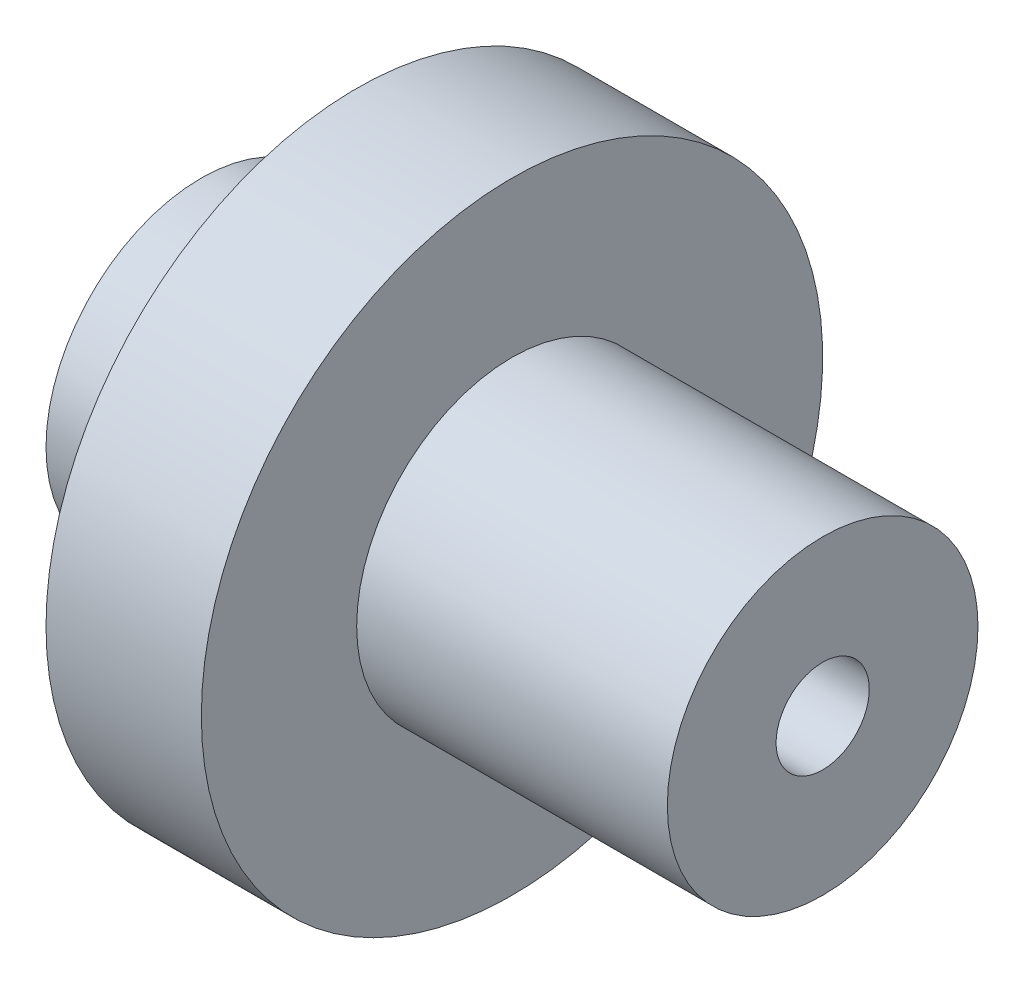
ISO-10303-21;
HEADER;
FILE_DESCRIPTION(('STEP AP214'),'2;1');
FILE_NAME('part.step','',(''),(''),'','','');
FILE_SCHEMA(('AUTOMOTIVE_DESIGN { 1 0 10303 214 1 1 1 1 }'));
ENDSEC;
DATA;
#1=APPLICATION_CONTEXT('core data for automotive mechanical design processes');
#2=APPLICATION_PROTOCOL_DEFINITION('international standard','automotive_design',2000,#1);
#3=PRODUCT_CONTEXT('',#1,'mechanical');
#4=PRODUCT('Part','Part','',(#3));
#5=PRODUCT_RELATED_PRODUCT_CATEGORY('part','',(#4));
#6=PRODUCT_DEFINITION_FORMATION('','',#4);
#7=PRODUCT_DEFINITION_CONTEXT('part definition',#1,'design');
#8=PRODUCT_DEFINITION('design','',#6,#7);
#9=PRODUCT_DEFINITION_SHAPE('','',#8);
#10=(LENGTH_UNIT() NAMED_UNIT(*) SI_UNIT(.MILLI.,.METRE.));
#11=(NAMED_UNIT(*) PLANE_ANGLE_UNIT() SI_UNIT($,.RADIAN.));
#12=(NAMED_UNIT(*) SI_UNIT($,.STERADIAN.) SOLID_ANGLE_UNIT());
#13=UNCERTAINTY_MEASURE_WITH_UNIT(LENGTH_MEASURE(1.E-05),#10,'distance_accuracy_value','');
#14=(GEOMETRIC_REPRESENTATION_CONTEXT(3) GLOBAL_UNCERTAINTY_ASSIGNED_CONTEXT((#13)) GLOBAL_UNIT_ASSIGNED_CONTEXT((#10,
#11,#12)) REPRESENTATION_CONTEXT('',''));
#15=CARTESIAN_POINT('',(0.,0.,0.));
#16=DIRECTION('',(0.,0.,1.));
#17=DIRECTION('',(1.,0.,0.));
#18=AXIS2_PLACEMENT_3D('',#15,#16,#17);
#19=CARTESIAN_POINT('',(20.,0.,0.));
#20=DIRECTION('',(-1.,0.,0.));
#21=DIRECTION('',(0.,0.,1.));
#22=AXIS2_PLACEMENT_3D('',#19,#20,#21);
#23=CYLINDRICAL_SURFACE('',#22,5.);
#24=CARTESIAN_POINT('',(0.,0.,0.));
#25=DIRECTION('',(1.,0.,0.));
#26=DIRECTION('',(0.,0.,-1.));
#27=AXIS2_PLACEMENT_3D('',#24,#25,#26);
#28=CIRCLE('',#27,5.);
#29=CARTESIAN_POINT('',(0.,0.,-5.));
#30=VERTEX_POINT('',#29);
#31=EDGE_CURVE('E45',#30,#30,#28,.T.);
#32=ORIENTED_EDGE('',*,*,#31,.T.);
#33=EDGE_LOOP('',(#32));
#34=FACE_BOUND('',#33,.T.);
#35=CARTESIAN_POINT('',(5.,0.,0.));
#36=DIRECTION('',(1.,0.,0.));
#37=DIRECTION('',(0.,0.,-1.));
#38=AXIS2_PLACEMENT_3D('',#35,#36,#37);
#39=CIRCLE('',#38,5.);
#40=CARTESIAN_POINT('',(5.,0.,-5.));
#41=VERTEX_POINT('',#40);
#42=EDGE_CURVE('E10',#41,#41,#39,.T.);
#43=ORIENTED_EDGE('',*,*,#42,.F.);
#44=EDGE_LOOP('',(#43));
#45=FACE_BOUND('',#44,.T.);
#46=ADVANCED_FACE('F31',(#34,#45),#23,.T.);
#47=CARTESIAN_POINT('',(20.,0.,0.));
#48=DIRECTION('',(1.,0.,0.));
#49=DIRECTION('',(0.,0.,-1.));
#50=AXIS2_PLACEMENT_3D('',#47,#48,#49);
#51=CIRCLE('',#50,5.);
#52=CARTESIAN_POINT('',(20.,0.,-5.));
#53=VERTEX_POINT('',#52);
#54=EDGE_CURVE('E41',#53,#53,#51,.T.);
#55=ORIENTED_EDGE('',*,*,#54,.F.);
#56=EDGE_LOOP('',(#55));
#57=FACE_BOUND('',#56,.T.);
#58=CARTESIAN_POINT('',(10.,0.,0.));
#59=DIRECTION('',(-1.,0.,0.));
#60=DIRECTION('',(0.,0.,1.));
#61=AXIS2_PLACEMENT_3D('',#58,#59,#60);
#62=CIRCLE('',#61,5.);
#63=CARTESIAN_POINT('',(10.,0.,5.));
#64=VERTEX_POINT('',#63);
#65=EDGE_CURVE('E37',#64,#64,#62,.T.);
#66=ORIENTED_EDGE('',*,*,#65,.F.);
#67=EDGE_LOOP('',(#66));
#68=FACE_BOUND('',#67,.T.);
#69=ADVANCED_FACE('F75',(#57,#68),#23,.T.);
#70=CARTESIAN_POINT('',(20.,0.,0.));
#71=DIRECTION('',(1.,0.,0.));
#72=DIRECTION('',(0.,0.,-1.));
#73=AXIS2_PLACEMENT_3D('',#70,#71,#72);
#74=PLANE('',#73);
#75=CARTESIAN_POINT('',(20.,0.,0.));
#76=DIRECTION('',(1.,0.,0.));
#77=DIRECTION('',(0.,0.,-1.));
#78=AXIS2_PLACEMENT_3D('',#75,#76,#77);
#79=CIRCLE('',#78,1.5);
#80=CARTESIAN_POINT('',(20.,0.,-1.5));
#81=VERTEX_POINT('',#80);
#82=EDGE_CURVE('E53',#81,#81,#79,.T.);
#83=ORIENTED_EDGE('',*,*,#82,.F.);
#84=EDGE_LOOP('',(#83));
#85=FACE_BOUND('',#84,.T.);
#86=ORIENTED_EDGE('',*,*,#54,.T.);
#87=EDGE_LOOP('',(#86));
#88=FACE_BOUND('',#87,.T.);
#89=ADVANCED_FACE('F80',(#85,#88),#74,.T.);
#90=CARTESIAN_POINT('',(0.,0.,0.));
#91=DIRECTION('',(1.,0.,0.));
#92=DIRECTION('',(0.,0.,-1.));
#93=AXIS2_PLACEMENT_3D('',#90,#91,#92);
#94=PLANE('',#93);
#95=CARTESIAN_POINT('',(0.,0.,0.));
#96=DIRECTION('',(-1.,0.,0.));
#97=DIRECTION('',(0.,0.,1.));
#98=AXIS2_PLACEMENT_3D('',#95,#96,#97);
#99=CIRCLE('',#98,1.5);
#100=CARTESIAN_POINT('',(0.,0.,1.5));
#101=VERTEX_POINT('',#100);
#102=EDGE_CURVE('E49',#101,#101,#99,.T.);
#103=ORIENTED_EDGE('',*,*,#102,.F.);
#104=EDGE_LOOP('',(#103));
#105=FACE_BOUND('',#104,.T.);
#106=ORIENTED_EDGE('',*,*,#31,.F.);
#107=EDGE_LOOP('',(#106));
#108=FACE_BOUND('',#107,.T.);
#109=ADVANCED_FACE('F85',(#105,#108),#94,.F.);
#110=CARTESIAN_POINT('',(10.,0.,0.));
#111=DIRECTION('',(-1.,0.,0.));
#112=DIRECTION('',(0.,0.,1.));
#113=AXIS2_PLACEMENT_3D('',#110,#111,#112);
#114=CYLINDRICAL_SURFACE('',#113,1.5);
#115=ORIENTED_EDGE('',*,*,#82,.T.);
#116=EDGE_LOOP('',(#115));
#117=FACE_BOUND('',#116,.T.);
#118=ORIENTED_EDGE('',*,*,#102,.T.);
#119=EDGE_LOOP('',(#118));
#120=FACE_BOUND('',#119,.T.);
#121=ADVANCED_FACE('F87',(#117,#120),#114,.F.);
#122=CARTESIAN_POINT('',(5.,5.,0.));
#123=DIRECTION('',(1.,0.,0.));
#124=DIRECTION('',(0.,0.,-1.));
#125=AXIS2_PLACEMENT_3D('',#122,#123,#124);
#126=PLANE('',#125);
#127=ORIENTED_EDGE('',*,*,#42,.T.);
#128=EDGE_LOOP('',(#127));
#129=FACE_BOUND('',#128,.T.);
#130=CARTESIAN_POINT('',(5.,0.,0.));
#131=DIRECTION('',(-1.,0.,0.));
#132=DIRECTION('',(0.,0.,1.));
#133=AXIS2_PLACEMENT_3D('',#130,#131,#132);
#134=CIRCLE('',#133,10.);
#135=CARTESIAN_POINT('',(5.,0.,10.));
#136=VERTEX_POINT('',#135);
#137=EDGE_CURVE('E56',#136,#136,#134,.T.);
#138=ORIENTED_EDGE('',*,*,#137,.T.);
#139=EDGE_LOOP('',(#138));
#140=FACE_BOUND('',#139,.T.);
#141=ADVANCED_FACE('F71',(#129,#140),#126,.F.);
#142=CARTESIAN_POINT('',(0.,0.,0.));
#143=DIRECTION('',(-1.,0.,0.));
#144=DIRECTION('',(0.,0.,1.));
#145=AXIS2_PLACEMENT_3D('',#142,#143,#144);
#146=CYLINDRICAL_SURFACE('',#145,10.);
#147=ORIENTED_EDGE('',*,*,#137,.F.);
#148=EDGE_LOOP('',(#147));
#149=FACE_BOUND('',#148,.T.);
#150=CARTESIAN_POINT('',(10.,0.,0.));
#151=DIRECTION('',(-1.,0.,0.));
#152=DIRECTION('',(0.,0.,1.));
#153=AXIS2_PLACEMENT_3D('',#150,#151,#152);
#154=CIRCLE('',#153,10.);
#155=CARTESIAN_POINT('',(10.,0.,10.));
#156=VERTEX_POINT('',#155);
#157=EDGE_CURVE('E59',#156,#156,#154,.T.);
#158=ORIENTED_EDGE('',*,*,#157,.T.);
#159=EDGE_LOOP('',(#158));
#160=FACE_BOUND('',#159,.T.);
#161=ADVANCED_FACE('F63',(#149,#160),#146,.T.);
#162=CARTESIAN_POINT('',(10.,10.,0.));
#163=DIRECTION('',(-1.,0.,0.));
#164=DIRECTION('',(0.,0.,1.));
#165=AXIS2_PLACEMENT_3D('',#162,#163,#164);
#166=PLANE('',#165);
#167=ORIENTED_EDGE('',*,*,#157,.F.);
#168=EDGE_LOOP('',(#167));
#169=FACE_BOUND('',#168,.T.);
#170=ORIENTED_EDGE('',*,*,#65,.T.);
#171=EDGE_LOOP('',(#170));
#172=FACE_BOUND('',#171,.T.);
#173=ADVANCED_FACE('F65',(#169,#172),#166,.F.);
#174=CLOSED_SHELL('',(#46,#69,#89,#109,#121,#141,#161,#173));
#175=MANIFOLD_SOLID_BREP('B2',#174);
#176=ADVANCED_BREP_SHAPE_REPRESENTATION('',(#18,#175),#14);
#177=SHAPE_DEFINITION_REPRESENTATION(#9,#176);
ENDSEC;
END-ISO-10303-21;
